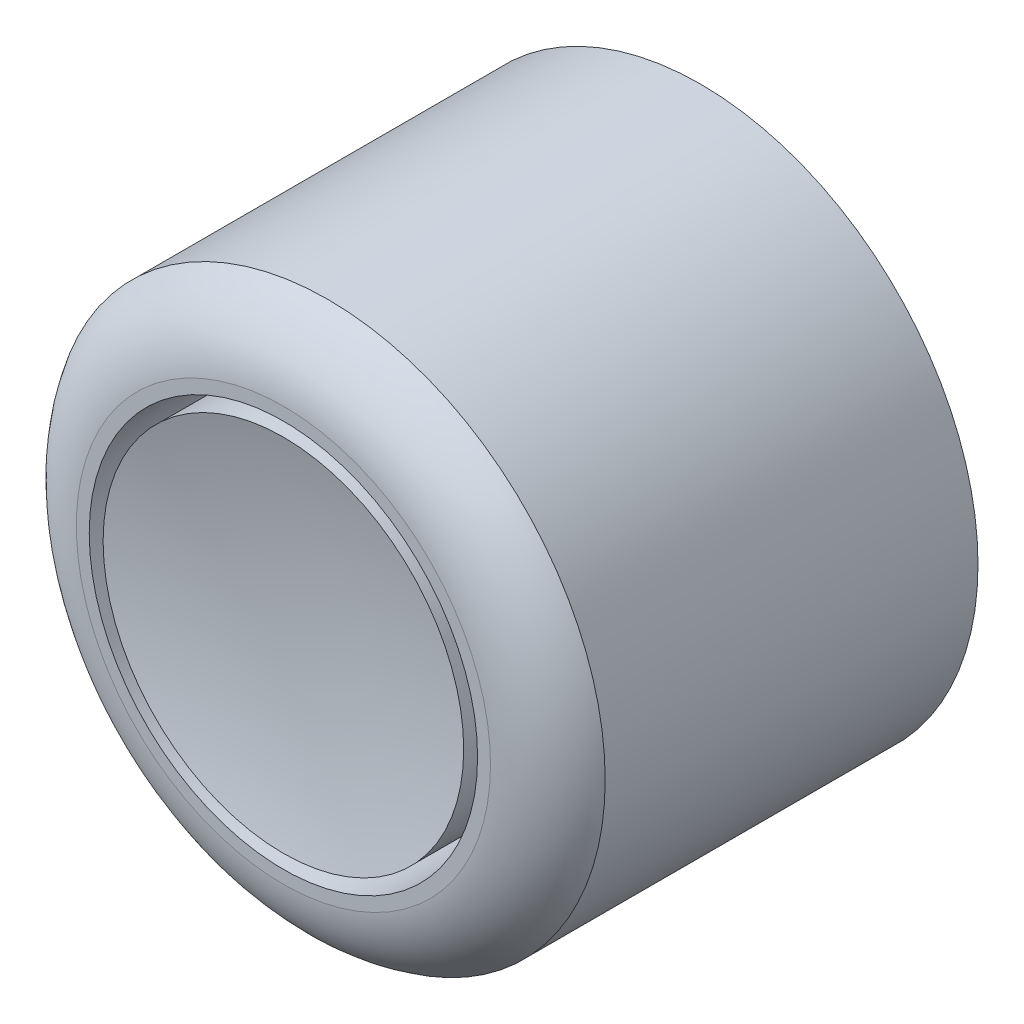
from build123d import *


with BuildPart() as part:
    # Sketch1 → Revolve1 (revolve)
    with BuildSketch(Plane(origin=(0, 0, 0), x_dir=(0, 0, -1), z_dir=(1, 0, 0)), mode=Mode.PRIVATE) as revolve1_sk:
        with BuildLine():
            ThreePointArc((0, 10.31875), (0.951306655, 5.19830505), (1.27, 0))
            Line((1.27, 0), (23.876, 0))
            Line((23.876, 0), (23.876, 15.875))
            Line((23.876, 15.875), (2.54, 15.875))
            ThreePointArc((2.54, 15.875), (0.766941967, 14.180267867), (0, 11.850535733))
            Line((0, 11.850535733), (0, 11.1125))
            Line((0, 11.1125), (12.7, 11.1125))
            Line((12.7, 11.1125), (12.7, 10.31875))
            Line((12.7, 10.31875), (0, 10.31875))
        make_face()
    revolve(revolve1_sk.sketch.rotate(Axis((0, 0, 0), (0, 0, -1)), 90), axis=Axis((0, 0, 0), (0, 0, -1)))


solid = part.part
